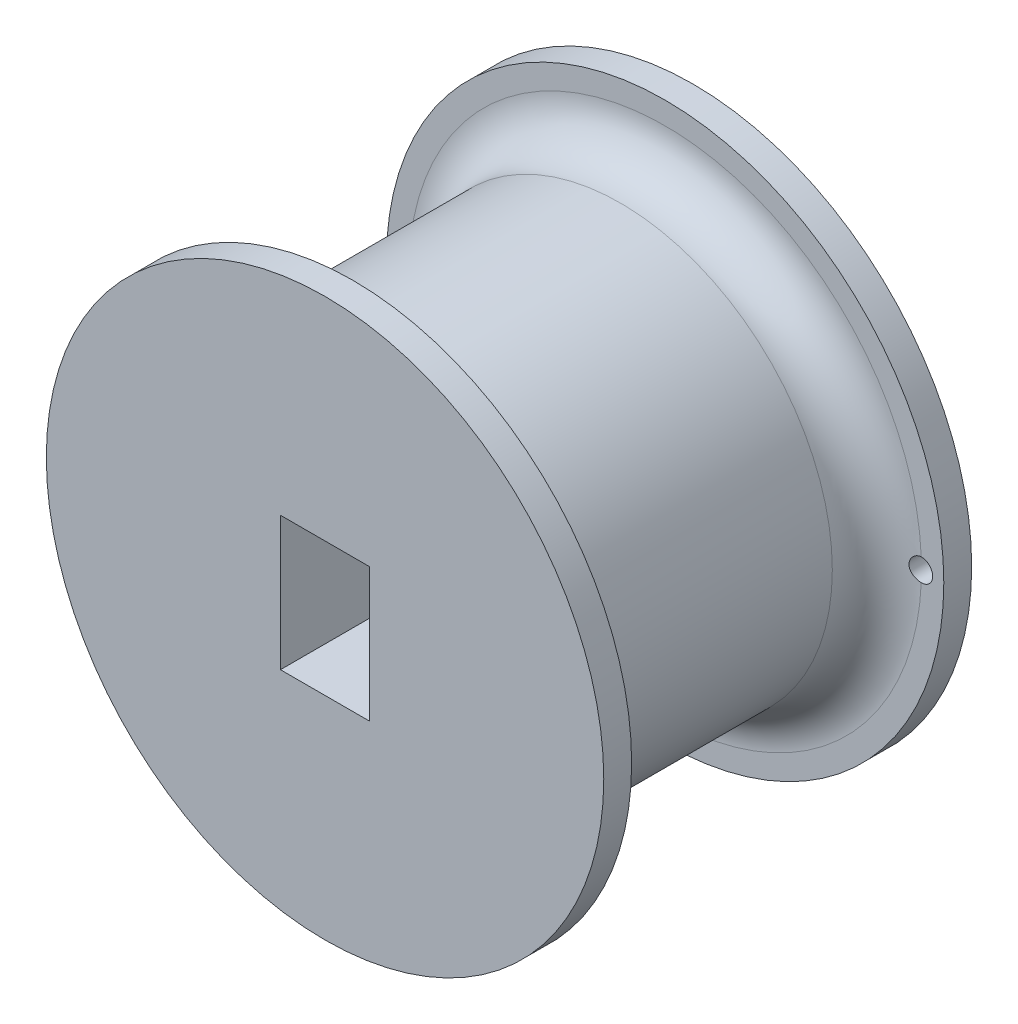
ISO-10303-21;
HEADER;
FILE_DESCRIPTION(('STEP AP214'),'2;1');
FILE_NAME('part.step','',(''),(''),'','','');
FILE_SCHEMA(('AUTOMOTIVE_DESIGN { 1 0 10303 214 1 1 1 1 }'));
ENDSEC;
DATA;
#1=APPLICATION_CONTEXT('core data for automotive mechanical design processes');
#2=APPLICATION_PROTOCOL_DEFINITION('international standard','automotive_design',2000,#1);
#3=PRODUCT_CONTEXT('',#1,'mechanical');
#4=PRODUCT('Part','Part','',(#3));
#5=PRODUCT_RELATED_PRODUCT_CATEGORY('part','',(#4));
#6=PRODUCT_DEFINITION_FORMATION('','',#4);
#7=PRODUCT_DEFINITION_CONTEXT('part definition',#1,'design');
#8=PRODUCT_DEFINITION('design','',#6,#7);
#9=PRODUCT_DEFINITION_SHAPE('','',#8);
#10=(LENGTH_UNIT() NAMED_UNIT(*) SI_UNIT(.MILLI.,.METRE.));
#11=(NAMED_UNIT(*) PLANE_ANGLE_UNIT() SI_UNIT($,.RADIAN.));
#12=(NAMED_UNIT(*) SI_UNIT($,.STERADIAN.) SOLID_ANGLE_UNIT());
#13=UNCERTAINTY_MEASURE_WITH_UNIT(LENGTH_MEASURE(1.E-05),#10,'distance_accuracy_value','');
#14=(GEOMETRIC_REPRESENTATION_CONTEXT(3) GLOBAL_UNCERTAINTY_ASSIGNED_CONTEXT((#13)) GLOBAL_UNIT_ASSIGNED_CONTEXT((#10,
#11,#12)) REPRESENTATION_CONTEXT('',''));
#15=CARTESIAN_POINT('',(0.,0.,0.));
#16=DIRECTION('',(0.,0.,1.));
#17=DIRECTION('',(1.,0.,0.));
#18=AXIS2_PLACEMENT_3D('',#15,#16,#17);
#19=CARTESIAN_POINT('',(0.,0.,2.5));
#20=DIRECTION('',(0.,0.,1.));
#21=DIRECTION('',(1.,0.,0.));
#22=AXIS2_PLACEMENT_3D('',#19,#20,#21);
#23=PLANE('',#22);
#24=CARTESIAN_POINT('',(0.,0.,2.5));
#25=DIRECTION('',(0.,0.,1.));
#26=DIRECTION('',(1.,0.,0.));
#27=AXIS2_PLACEMENT_3D('',#24,#25,#26);
#28=CIRCLE('',#27,25.);
#29=CARTESIAN_POINT('',(25.,0.,2.5));
#30=VERTEX_POINT('',#29);
#31=EDGE_CURVE('E219',#30,#30,#28,.T.);
#32=ORIENTED_EDGE('',*,*,#31,.T.);
#33=EDGE_LOOP('',(#32));
#34=FACE_BOUND('',#33,.T.);
#35=CARTESIAN_POINT('',(0.,0.,2.5));
#36=DIRECTION('',(0.,0.,1.));
#37=DIRECTION('',(1.,0.,0.));
#38=AXIS2_PLACEMENT_3D('',#35,#36,#37);
#39=CIRCLE('',#38,23.);
#40=CARTESIAN_POINT('',(22.9782608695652,-0.999763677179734,2.5));
#41=VERTEX_POINT('',#40);
#42=CARTESIAN_POINT('',(-22.9782608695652,-0.999763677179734,2.5));
#43=VERTEX_POINT('',#42);
#44=EDGE_CURVE('E120',#41,#43,#39,.F.);
#45=ORIENTED_EDGE('',*,*,#44,.T.);
#46=CARTESIAN_POINT('',(-23.,0.,2.5));
#47=DIRECTION('',(0.,0.,1.));
#48=DIRECTION('',(1.,0.,0.));
#49=AXIS2_PLACEMENT_3D('',#46,#47,#48);
#50=CIRCLE('',#49,1.);
#51=CARTESIAN_POINT('',(-22.9782608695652,0.999763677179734,2.5));
#52=VERTEX_POINT('',#51);
#53=EDGE_CURVE('E66',#43,#52,#50,.F.);
#54=ORIENTED_EDGE('',*,*,#53,.T.);
#55=CARTESIAN_POINT('',(22.9782608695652,0.999763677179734,2.5));
#56=VERTEX_POINT('',#55);
#57=EDGE_CURVE('E75',#52,#56,#39,.F.);
#58=ORIENTED_EDGE('',*,*,#57,.T.);
#59=CARTESIAN_POINT('',(23.,0.,2.5));
#60=DIRECTION('',(0.,0.,1.));
#61=DIRECTION('',(1.,0.,0.));
#62=AXIS2_PLACEMENT_3D('',#59,#60,#61);
#63=CIRCLE('',#62,1.);
#64=EDGE_CURVE('E322',#41,#56,#63,.T.);
#65=ORIENTED_EDGE('',*,*,#64,.F.);
#66=EDGE_LOOP('',(#45,#54,#58,#65));
#67=FACE_BOUND('',#66,.T.);
#68=ADVANCED_FACE('F43',(#34,#67),#23,.T.);
#69=CARTESIAN_POINT('',(0.,0.,0.));
#70=DIRECTION('',(0.,0.,1.));
#71=DIRECTION('',(1.,0.,0.));
#72=AXIS2_PLACEMENT_3D('',#69,#70,#71);
#73=PLANE('',#72);
#74=CARTESIAN_POINT('',(23.,0.,0.));
#75=DIRECTION('',(0.,0.,-1.));
#76=DIRECTION('',(-1.,0.,0.));
#77=AXIS2_PLACEMENT_3D('',#74,#75,#76);
#78=CIRCLE('',#77,1.);
#79=CARTESIAN_POINT('',(22.,0.,0.));
#80=VERTEX_POINT('',#79);
#81=EDGE_CURVE('E122',#80,#80,#78,.T.);
#82=ORIENTED_EDGE('',*,*,#81,.F.);
#83=EDGE_LOOP('',(#82));
#84=FACE_BOUND('',#83,.T.);
#85=CARTESIAN_POINT('',(0.,-15.,0.));
#86=DIRECTION('',(0.,0.,-1.));
#87=DIRECTION('',(-1.,0.,0.));
#88=AXIS2_PLACEMENT_3D('',#85,#86,#87);
#89=CIRCLE('',#88,1.5);
#90=CARTESIAN_POINT('',(-1.5,-15.,0.));
#91=VERTEX_POINT('',#90);
#92=EDGE_CURVE('E318',#91,#91,#89,.T.);
#93=ORIENTED_EDGE('',*,*,#92,.F.);
#94=EDGE_LOOP('',(#93));
#95=FACE_BOUND('',#94,.T.);
#96=CARTESIAN_POINT('',(0.,15.,0.));
#97=DIRECTION('',(0.,0.,-1.));
#98=DIRECTION('',(-1.,0.,0.));
#99=AXIS2_PLACEMENT_3D('',#96,#97,#98);
#100=CIRCLE('',#99,1.5);
#101=CARTESIAN_POINT('',(-1.5,15.,0.));
#102=VERTEX_POINT('',#101);
#103=EDGE_CURVE('E259',#102,#102,#100,.T.);
#104=ORIENTED_EDGE('',*,*,#103,.F.);
#105=EDGE_LOOP('',(#104));
#106=FACE_BOUND('',#105,.T.);
#107=CARTESIAN_POINT('',(0.,0.,0.));
#108=DIRECTION('',(0.,0.,1.));
#109=DIRECTION('',(1.,0.,0.));
#110=AXIS2_PLACEMENT_3D('',#107,#108,#109);
#111=CIRCLE('',#110,25.);
#112=CARTESIAN_POINT('',(25.,0.,0.));
#113=VERTEX_POINT('',#112);
#114=EDGE_CURVE('E222',#113,#113,#111,.T.);
#115=ORIENTED_EDGE('',*,*,#114,.F.);
#116=EDGE_LOOP('',(#115));
#117=FACE_BOUND('',#116,.T.);
#118=DIRECTION('',(0.,1.,0.));
#119=VECTOR('',#118,1.);
#120=CARTESIAN_POINT('',(4.,6.,0.));
#121=LINE('',#120,#119);
#122=CARTESIAN_POINT('',(4.,-6.,0.));
#123=VERTEX_POINT('',#122);
#124=CARTESIAN_POINT('',(4.,6.,0.));
#125=VERTEX_POINT('',#124);
#126=EDGE_CURVE('E265',#123,#125,#121,.T.);
#127=ORIENTED_EDGE('',*,*,#126,.T.);
#128=DIRECTION('',(-1.,0.,0.));
#129=VECTOR('',#128,1.);
#130=CARTESIAN_POINT('',(-4.,6.,0.));
#131=LINE('',#130,#129);
#132=CARTESIAN_POINT('',(-4.,6.,0.));
#133=VERTEX_POINT('',#132);
#134=EDGE_CURVE('E269',#125,#133,#131,.T.);
#135=ORIENTED_EDGE('',*,*,#134,.T.);
#136=DIRECTION('',(0.,-1.,0.));
#137=VECTOR('',#136,1.);
#138=CARTESIAN_POINT('',(-4.,6.,0.));
#139=LINE('',#138,#137);
#140=CARTESIAN_POINT('',(-4.,-6.,0.));
#141=VERTEX_POINT('',#140);
#142=EDGE_CURVE('E273',#133,#141,#139,.T.);
#143=ORIENTED_EDGE('',*,*,#142,.T.);
#144=DIRECTION('',(1.,0.,0.));
#145=VECTOR('',#144,1.);
#146=CARTESIAN_POINT('',(-4.,-6.,0.));
#147=LINE('',#146,#145);
#148=EDGE_CURVE('E277',#141,#123,#147,.T.);
#149=ORIENTED_EDGE('',*,*,#148,.T.);
#150=EDGE_LOOP('',(#127,#135,#143,#149));
#151=FACE_BOUND('',#150,.T.);
#152=CARTESIAN_POINT('',(-23.,0.,0.));
#153=DIRECTION('',(0.,0.,1.));
#154=DIRECTION('',(1.,0.,0.));
#155=AXIS2_PLACEMENT_3D('',#152,#153,#154);
#156=CIRCLE('',#155,1.);
#157=CARTESIAN_POINT('',(-22.,0.,0.));
#158=VERTEX_POINT('',#157);
#159=EDGE_CURVE('E123',#158,#158,#156,.T.);
#160=ORIENTED_EDGE('',*,*,#159,.T.);
#161=EDGE_LOOP('',(#160));
#162=FACE_BOUND('',#161,.T.);
#163=ADVANCED_FACE('F206',(#84,#95,#106,#117,#151,#162),#73,.F.);
#164=CARTESIAN_POINT('',(0.,0.,6.5));
#165=DIRECTION('',(0.,0.,1.));
#166=DIRECTION('',(1.,0.,0.));
#167=AXIS2_PLACEMENT_3D('',#164,#165,#166);
#168=TOROIDAL_SURFACE('',#167,23.,4.);
#169=CARTESIAN_POINT('',(0.,0.,6.5));
#170=DIRECTION('',(0.,0.,1.));
#171=DIRECTION('',(1.,0.,0.));
#172=AXIS2_PLACEMENT_3D('',#169,#170,#171);
#173=CIRCLE('',#172,19.);
#174=CARTESIAN_POINT('',(19.,0.,6.5));
#175=VERTEX_POINT('',#174);
#176=EDGE_CURVE('E128',#175,#175,#173,.T.);
#177=ORIENTED_EDGE('',*,*,#176,.F.);
#178=EDGE_LOOP('',(#177));
#179=FACE_BOUND('',#178,.T.);
#180=CARTESIAN_POINT('',(-23.0002,-0.999999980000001,2.50006010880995));
#181=CARTESIAN_POINT('',(-22.9725756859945,-1.00000580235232,2.49990725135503));
#182=CARTESIAN_POINT('',(-22.9449630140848,-0.998865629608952,2.50004329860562));
#183=CARTESIAN_POINT('',(-22.8899388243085,-0.99430837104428,2.50088366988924));
#184=CARTESIAN_POINT('',(-22.862527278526,-0.990891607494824,2.50158791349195));
#185=CARTESIAN_POINT('',(-22.7810021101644,-0.977274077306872,2.50453318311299));
#186=CARTESIAN_POINT('',(-22.7274409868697,-0.963705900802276,2.50760600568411));
#187=CARTESIAN_POINT('',(-22.6234355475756,-0.928023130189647,2.51566010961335));
#188=CARTESIAN_POINT('',(-22.5729913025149,-0.905908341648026,2.52064143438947));
#189=CARTESIAN_POINT('',(-22.4765118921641,-0.853794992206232,2.53198889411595));
#190=CARTESIAN_POINT('',(-22.4304777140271,-0.823794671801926,2.53835533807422));
#191=CARTESIAN_POINT('',(-22.3432194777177,-0.756136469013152,2.55191950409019));
#192=CARTESIAN_POINT('',(-22.3020964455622,-0.718350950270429,2.55913008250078));
#193=CARTESIAN_POINT('',(-22.2266840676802,-0.636460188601,2.57348664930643));
#194=CARTESIAN_POINT('',(-22.1923962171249,-0.592353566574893,2.58063262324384));
#195=CARTESIAN_POINT('',(-22.1310412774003,-0.498122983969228,2.59415607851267));
#196=CARTESIAN_POINT('',(-22.1041125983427,-0.447906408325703,2.60051773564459));
#197=CARTESIAN_POINT('',(-22.0591198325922,-0.343475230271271,2.61152489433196));
#198=CARTESIAN_POINT('',(-22.0410537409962,-0.289261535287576,2.61617078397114));
#199=CARTESIAN_POINT('',(-22.0146614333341,-0.179521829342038,2.62306582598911));
#200=CARTESIAN_POINT('',(-22.0061464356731,-0.124044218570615,2.62536135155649));
#201=CARTESIAN_POINT('',(-21.9985134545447,-0.0124030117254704,2.62741578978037));
#202=CARTESIAN_POINT('',(-21.9993939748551,0.043760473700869,2.62717510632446));
#203=CARTESIAN_POINT('',(-22.0103636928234,0.153565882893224,2.62423171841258));
#204=CARTESIAN_POINT('',(-22.0202026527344,0.207234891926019,2.62159592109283));
#205=CARTESIAN_POINT('',(-22.0484102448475,0.312133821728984,2.61428428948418));
#206=CARTESIAN_POINT('',(-22.0667795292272,0.363363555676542,2.60960829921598));
#207=CARTESIAN_POINT('',(-22.1117375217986,0.462590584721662,2.59871248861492));
#208=CARTESIAN_POINT('',(-22.1384154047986,0.51054557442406,2.59247607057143));
#209=CARTESIAN_POINT('',(-22.1991758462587,0.601388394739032,2.57920652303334));
#210=CARTESIAN_POINT('',(-22.2332596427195,0.644275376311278,2.57217326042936));
#211=CARTESIAN_POINT('',(-22.3091149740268,0.725151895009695,2.5578685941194));
#212=CARTESIAN_POINT('',(-22.3510911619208,0.762949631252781,2.55059653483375));
#213=CARTESIAN_POINT('',(-22.4408994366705,0.831011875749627,2.53685589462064));
#214=CARTESIAN_POINT('',(-22.4887328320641,0.861274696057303,2.53038749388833));
#215=CARTESIAN_POINT('',(-22.5890798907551,0.913428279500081,2.51896730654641));
#216=CARTESIAN_POINT('',(-22.6416045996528,0.935298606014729,2.51401922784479));
#217=CARTESIAN_POINT('',(-22.7497103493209,0.969826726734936,2.50622170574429));
#218=CARTESIAN_POINT('',(-22.8052869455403,0.982497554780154,2.50336929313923));
#219=CARTESIAN_POINT('',(-22.8844880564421,0.993578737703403,2.5010359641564));
#220=CARTESIAN_POINT('',(-22.907581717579,0.995991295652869,2.50055878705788));
#221=CARTESIAN_POINT('',(-22.9538470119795,0.999202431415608,2.50000757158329));
#222=CARTESIAN_POINT('',(-22.9770184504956,1.00000369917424,2.49993286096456));
#223=CARTESIAN_POINT('',(-23.0002,0.999999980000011,2.50006010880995));
#224=B_SPLINE_CURVE_WITH_KNOTS('',3,(#180,#181,#182,#183,#184,#185,#186,#187,#188,#189,#190,
#191,#192,#193,#194,#195,#196,#197,#198,#199,#200,#201,#202,#203,#204,#205,#206,#207,#208,#209,
#210,#211,#212,#213,#214,#215,#216,#217,#218,#219,#220,#221,#222,#223),.UNSPECIFIED.,.F.,.F.,(4,
2,2,2,2,2,2,2,2,2,2,2,2,2,2,2,2,2,2,2,2,4),(0.,0.0828223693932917,0.165633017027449,
0.33078952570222,0.495949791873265,0.661146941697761,0.8293055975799,0.997500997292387,
1.16867067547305,1.3398016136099,1.50748695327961,1.67514558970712,1.83826002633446,
2.00138693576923,2.16632878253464,2.33129822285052,2.50135474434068,2.67144932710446,
2.84195551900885,3.01221966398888,3.08184415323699,3.15135231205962),.UNSPECIFIED.);
#225=EDGE_CURVE('E11',#43,#52,#224,.T.);
#226=ORIENTED_EDGE('',*,*,#225,.F.);
#227=ORIENTED_EDGE('',*,*,#44,.F.);
#228=CARTESIAN_POINT('',(23.0002,-0.999999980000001,2.50006010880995));
#229=CARTESIAN_POINT('',(22.9725756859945,-1.00000580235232,2.49990725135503));
#230=CARTESIAN_POINT('',(22.9449630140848,-0.998865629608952,2.50004329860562));
#231=CARTESIAN_POINT('',(22.8899388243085,-0.99430837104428,2.50088366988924));
#232=CARTESIAN_POINT('',(22.862527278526,-0.990891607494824,2.50158791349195));
#233=CARTESIAN_POINT('',(22.7810021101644,-0.977274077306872,2.50453318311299));
#234=CARTESIAN_POINT('',(22.7274409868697,-0.963705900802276,2.50760600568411));
#235=CARTESIAN_POINT('',(22.6234355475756,-0.928023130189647,2.51566010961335));
#236=CARTESIAN_POINT('',(22.5729913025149,-0.905908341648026,2.52064143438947));
#237=CARTESIAN_POINT('',(22.4765118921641,-0.853794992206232,2.53198889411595));
#238=CARTESIAN_POINT('',(22.4304777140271,-0.823794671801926,2.53835533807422));
#239=CARTESIAN_POINT('',(22.3432194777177,-0.756136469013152,2.55191950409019));
#240=CARTESIAN_POINT('',(22.3020964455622,-0.718350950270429,2.55913008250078));
#241=CARTESIAN_POINT('',(22.2266840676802,-0.636460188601,2.57348664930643));
#242=CARTESIAN_POINT('',(22.1923962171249,-0.592353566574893,2.58063262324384));
#243=CARTESIAN_POINT('',(22.1310412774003,-0.498122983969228,2.59415607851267));
#244=CARTESIAN_POINT('',(22.1041125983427,-0.447906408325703,2.60051773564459));
#245=CARTESIAN_POINT('',(22.0591198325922,-0.343475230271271,2.61152489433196));
#246=CARTESIAN_POINT('',(22.0410537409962,-0.289261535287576,2.61617078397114));
#247=CARTESIAN_POINT('',(22.0146614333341,-0.179521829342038,2.62306582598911));
#248=CARTESIAN_POINT('',(22.0061464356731,-0.124044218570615,2.62536135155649));
#249=CARTESIAN_POINT('',(21.9985134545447,-0.0124030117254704,2.62741578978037));
#250=CARTESIAN_POINT('',(21.9993939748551,0.043760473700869,2.62717510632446));
#251=CARTESIAN_POINT('',(22.0103636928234,0.153565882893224,2.62423171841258));
#252=CARTESIAN_POINT('',(22.0202026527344,0.207234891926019,2.62159592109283));
#253=CARTESIAN_POINT('',(22.0484102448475,0.312133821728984,2.61428428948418));
#254=CARTESIAN_POINT('',(22.0667795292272,0.363363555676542,2.60960829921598));
#255=CARTESIAN_POINT('',(22.1117375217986,0.462590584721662,2.59871248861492));
#256=CARTESIAN_POINT('',(22.1384154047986,0.51054557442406,2.59247607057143));
#257=CARTESIAN_POINT('',(22.1991758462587,0.601388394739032,2.57920652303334));
#258=CARTESIAN_POINT('',(22.2332596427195,0.644275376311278,2.57217326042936));
#259=CARTESIAN_POINT('',(22.3091149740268,0.725151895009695,2.5578685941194));
#260=CARTESIAN_POINT('',(22.3510911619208,0.762949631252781,2.55059653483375));
#261=CARTESIAN_POINT('',(22.4408994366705,0.831011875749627,2.53685589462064));
#262=CARTESIAN_POINT('',(22.4887328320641,0.861274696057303,2.53038749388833));
#263=CARTESIAN_POINT('',(22.5890798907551,0.913428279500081,2.51896730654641));
#264=CARTESIAN_POINT('',(22.6416045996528,0.935298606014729,2.51401922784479));
#265=CARTESIAN_POINT('',(22.7497103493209,0.969826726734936,2.50622170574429));
#266=CARTESIAN_POINT('',(22.8052869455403,0.982497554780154,2.50336929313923));
#267=CARTESIAN_POINT('',(22.8844880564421,0.993578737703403,2.5010359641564));
#268=CARTESIAN_POINT('',(22.907581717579,0.995991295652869,2.50055878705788));
#269=CARTESIAN_POINT('',(22.9538470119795,0.999202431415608,2.50000757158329));
#270=CARTESIAN_POINT('',(22.9770184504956,1.00000369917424,2.49993286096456));
#271=CARTESIAN_POINT('',(23.0002,0.999999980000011,2.50006010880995));
#272=B_SPLINE_CURVE_WITH_KNOTS('',3,(#228,#229,#230,#231,#232,#233,#234,#235,#236,#237,#238,
#239,#240,#241,#242,#243,#244,#245,#246,#247,#248,#249,#250,#251,#252,#253,#254,#255,#256,#257,
#258,#259,#260,#261,#262,#263,#264,#265,#266,#267,#268,#269,#270,#271),.UNSPECIFIED.,.F.,.F.,(4,
2,2,2,2,2,2,2,2,2,2,2,2,2,2,2,2,2,2,2,2,4),(0.,0.0828223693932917,0.165633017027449,
0.33078952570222,0.495949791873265,0.661146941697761,0.8293055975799,0.997500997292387,
1.16867067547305,1.3398016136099,1.50748695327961,1.67514558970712,1.83826002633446,
2.00138693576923,2.16632878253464,2.33129822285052,2.50135474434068,2.67144932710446,
2.84195551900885,3.01221966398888,3.08184415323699,3.15135231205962),.UNSPECIFIED.);
#273=EDGE_CURVE('E57',#41,#56,#272,.T.);
#274=ORIENTED_EDGE('',*,*,#273,.T.);
#275=ORIENTED_EDGE('',*,*,#57,.F.);
#276=EDGE_LOOP('',(#226,#227,#274,#275));
#277=FACE_BOUND('',#276,.T.);
#278=ADVANCED_FACE('F126',(#179,#277),#168,.F.);
#279=CARTESIAN_POINT('',(0.,0.,2.5));
#280=DIRECTION('',(0.,0.,-1.));
#281=DIRECTION('',(-1.,0.,0.));
#282=AXIS2_PLACEMENT_3D('',#279,#280,#281);
#283=CYLINDRICAL_SURFACE('',#282,25.);
#284=ORIENTED_EDGE('',*,*,#31,.F.);
#285=EDGE_LOOP('',(#284));
#286=FACE_BOUND('',#285,.T.);
#287=ORIENTED_EDGE('',*,*,#114,.T.);
#288=EDGE_LOOP('',(#287));
#289=FACE_BOUND('',#288,.T.);
#290=ADVANCED_FACE('F202',(#286,#289),#283,.T.);
#291=CARTESIAN_POINT('',(4.,6.,2.5));
#292=DIRECTION('',(-1.,0.,0.));
#293=DIRECTION('',(0.,-1.,0.));
#294=AXIS2_PLACEMENT_3D('',#291,#292,#293);
#295=PLANE('',#294);
#296=ORIENTED_EDGE('',*,*,#126,.F.);
#297=DIRECTION('',(0.,0.,-1.));
#298=VECTOR('',#297,1.);
#299=CARTESIAN_POINT('',(4.,-6.,2.5));
#300=LINE('',#299,#298);
#301=CARTESIAN_POINT('',(4.,-6.,33.));
#302=VERTEX_POINT('',#301);
#303=EDGE_CURVE('E281',#302,#123,#300,.T.);
#304=ORIENTED_EDGE('',*,*,#303,.F.);
#305=DIRECTION('',(0.,-1.,0.));
#306=VECTOR('',#305,1.);
#307=CARTESIAN_POINT('',(4.,0.,33.));
#308=LINE('',#307,#306);
#309=CARTESIAN_POINT('',(4.,6.,33.));
#310=VERTEX_POINT('',#309);
#311=EDGE_CURVE('E305',#310,#302,#308,.T.);
#312=ORIENTED_EDGE('',*,*,#311,.F.);
#313=DIRECTION('',(0.,0.,-1.));
#314=VECTOR('',#313,1.);
#315=CARTESIAN_POINT('',(4.,6.,2.5));
#316=LINE('',#315,#314);
#317=EDGE_CURVE('E225',#310,#125,#316,.T.);
#318=ORIENTED_EDGE('',*,*,#317,.T.);
#319=EDGE_LOOP('',(#296,#304,#312,#318));
#320=FACE_BOUND('',#319,.T.);
#321=ADVANCED_FACE('F198',(#320),#295,.T.);
#322=CARTESIAN_POINT('',(-4.,6.,2.5));
#323=DIRECTION('',(0.,-1.,0.));
#324=DIRECTION('',(0.,0.,-1.));
#325=AXIS2_PLACEMENT_3D('',#322,#323,#324);
#326=PLANE('',#325);
#327=ORIENTED_EDGE('',*,*,#134,.F.);
#328=ORIENTED_EDGE('',*,*,#317,.F.);
#329=DIRECTION('',(1.,0.,0.));
#330=VECTOR('',#329,1.);
#331=CARTESIAN_POINT('',(0.,6.,33.));
#332=LINE('',#331,#330);
#333=CARTESIAN_POINT('',(-4.,6.,33.));
#334=VERTEX_POINT('',#333);
#335=EDGE_CURVE('E293',#334,#310,#332,.T.);
#336=ORIENTED_EDGE('',*,*,#335,.F.);
#337=DIRECTION('',(0.,0.,-1.));
#338=VECTOR('',#337,1.);
#339=CARTESIAN_POINT('',(-4.,6.,2.5));
#340=LINE('',#339,#338);
#341=EDGE_CURVE('E232',#334,#133,#340,.T.);
#342=ORIENTED_EDGE('',*,*,#341,.T.);
#343=EDGE_LOOP('',(#327,#328,#336,#342));
#344=FACE_BOUND('',#343,.T.);
#345=ADVANCED_FACE('F194',(#344),#326,.T.);
#346=CARTESIAN_POINT('',(-4.,6.,2.5));
#347=DIRECTION('',(1.,0.,0.));
#348=DIRECTION('',(0.,1.,0.));
#349=AXIS2_PLACEMENT_3D('',#346,#347,#348);
#350=PLANE('',#349);
#351=ORIENTED_EDGE('',*,*,#142,.F.);
#352=ORIENTED_EDGE('',*,*,#341,.F.);
#353=DIRECTION('',(0.,1.,0.));
#354=VECTOR('',#353,1.);
#355=CARTESIAN_POINT('',(-4.,0.,33.));
#356=LINE('',#355,#354);
#357=CARTESIAN_POINT('',(-4.,-6.,33.));
#358=VERTEX_POINT('',#357);
#359=EDGE_CURVE('E256',#358,#334,#356,.T.);
#360=ORIENTED_EDGE('',*,*,#359,.F.);
#361=DIRECTION('',(0.,0.,-1.));
#362=VECTOR('',#361,1.);
#363=CARTESIAN_POINT('',(-4.,-6.,2.5));
#364=LINE('',#363,#362);
#365=EDGE_CURVE('E285',#358,#141,#364,.T.);
#366=ORIENTED_EDGE('',*,*,#365,.T.);
#367=EDGE_LOOP('',(#351,#352,#360,#366));
#368=FACE_BOUND('',#367,.T.);
#369=ADVANCED_FACE('F190',(#368),#350,.T.);
#370=CARTESIAN_POINT('',(-4.,-6.,2.5));
#371=DIRECTION('',(0.,1.,0.));
#372=DIRECTION('',(0.,0.,1.));
#373=AXIS2_PLACEMENT_3D('',#370,#371,#372);
#374=PLANE('',#373);
#375=ORIENTED_EDGE('',*,*,#148,.F.);
#376=ORIENTED_EDGE('',*,*,#365,.F.);
#377=DIRECTION('',(-1.,0.,0.));
#378=VECTOR('',#377,1.);
#379=CARTESIAN_POINT('',(0.,-6.,33.));
#380=LINE('',#379,#378);
#381=EDGE_CURVE('E263',#302,#358,#380,.T.);
#382=ORIENTED_EDGE('',*,*,#381,.F.);
#383=ORIENTED_EDGE('',*,*,#303,.T.);
#384=EDGE_LOOP('',(#375,#376,#382,#383));
#385=FACE_BOUND('',#384,.T.);
#386=ADVANCED_FACE('F186',(#385),#374,.T.);
#387=CARTESIAN_POINT('',(0.,0.,30.5));
#388=DIRECTION('',(0.,0.,-1.));
#389=DIRECTION('',(-1.,0.,0.));
#390=AXIS2_PLACEMENT_3D('',#387,#388,#389);
#391=CYLINDRICAL_SURFACE('',#390,19.);
#392=ORIENTED_EDGE('',*,*,#176,.T.);
#393=EDGE_LOOP('',(#392));
#394=FACE_BOUND('',#393,.T.);
#395=CARTESIAN_POINT('',(0.,0.,26.5));
#396=DIRECTION('',(0.,0.,1.));
#397=DIRECTION('',(1.,0.,0.));
#398=AXIS2_PLACEMENT_3D('',#395,#396,#397);
#399=CIRCLE('',#398,19.);
#400=CARTESIAN_POINT('',(19.,0.,26.5));
#401=VERTEX_POINT('',#400);
#402=EDGE_CURVE('E135',#401,#401,#399,.F.);
#403=ORIENTED_EDGE('',*,*,#402,.T.);
#404=EDGE_LOOP('',(#403));
#405=FACE_BOUND('',#404,.T.);
#406=ADVANCED_FACE('F179',(#394,#405),#391,.T.);
#407=CARTESIAN_POINT('',(0.,0.,30.5));
#408=DIRECTION('',(0.,0.,1.));
#409=DIRECTION('',(1.,0.,0.));
#410=AXIS2_PLACEMENT_3D('',#407,#408,#409);
#411=PLANE('',#410);
#412=CARTESIAN_POINT('',(0.,0.,30.5));
#413=DIRECTION('',(0.,0.,1.));
#414=DIRECTION('',(1.,0.,0.));
#415=AXIS2_PLACEMENT_3D('',#412,#413,#414);
#416=CIRCLE('',#415,23.);
#417=CARTESIAN_POINT('',(23.,0.,30.5));
#418=VERTEX_POINT('',#417);
#419=EDGE_CURVE('E133',#418,#418,#416,.T.);
#420=ORIENTED_EDGE('',*,*,#419,.T.);
#421=EDGE_LOOP('',(#420));
#422=FACE_BOUND('',#421,.T.);
#423=CARTESIAN_POINT('',(0.,0.,30.5));
#424=DIRECTION('',(0.,0.,1.));
#425=DIRECTION('',(1.,0.,0.));
#426=AXIS2_PLACEMENT_3D('',#423,#424,#425);
#427=CIRCLE('',#426,25.);
#428=CARTESIAN_POINT('',(25.,0.,30.5));
#429=VERTEX_POINT('',#428);
#430=EDGE_CURVE('E246',#429,#429,#427,.T.);
#431=ORIENTED_EDGE('',*,*,#430,.F.);
#432=EDGE_LOOP('',(#431));
#433=FACE_BOUND('',#432,.T.);
#434=ADVANCED_FACE('F176',(#422,#433),#411,.F.);
#435=CARTESIAN_POINT('',(0.,0.,33.));
#436=DIRECTION('',(0.,0.,-1.));
#437=DIRECTION('',(-1.,0.,0.));
#438=AXIS2_PLACEMENT_3D('',#435,#436,#437);
#439=CYLINDRICAL_SURFACE('',#438,25.);
#440=CARTESIAN_POINT('',(0.,0.,33.));
#441=DIRECTION('',(0.,0.,1.));
#442=DIRECTION('',(1.,0.,0.));
#443=AXIS2_PLACEMENT_3D('',#440,#441,#442);
#444=CIRCLE('',#443,25.);
#445=CARTESIAN_POINT('',(25.,0.,33.));
#446=VERTEX_POINT('',#445);
#447=EDGE_CURVE('E249',#446,#446,#444,.T.);
#448=ORIENTED_EDGE('',*,*,#447,.F.);
#449=EDGE_LOOP('',(#448));
#450=FACE_BOUND('',#449,.T.);
#451=ORIENTED_EDGE('',*,*,#430,.T.);
#452=EDGE_LOOP('',(#451));
#453=FACE_BOUND('',#452,.T.);
#454=ADVANCED_FACE('F174',(#450,#453),#439,.T.);
#455=CARTESIAN_POINT('',(0.,0.,33.));
#456=DIRECTION('',(0.,0.,1.));
#457=DIRECTION('',(1.,0.,0.));
#458=AXIS2_PLACEMENT_3D('',#455,#456,#457);
#459=PLANE('',#458);
#460=ORIENTED_EDGE('',*,*,#447,.T.);
#461=EDGE_LOOP('',(#460));
#462=FACE_BOUND('',#461,.T.);
#463=ORIENTED_EDGE('',*,*,#359,.T.);
#464=ORIENTED_EDGE('',*,*,#335,.T.);
#465=ORIENTED_EDGE('',*,*,#311,.T.);
#466=ORIENTED_EDGE('',*,*,#381,.T.);
#467=EDGE_LOOP('',(#463,#464,#465,#466));
#468=FACE_BOUND('',#467,.T.);
#469=ADVANCED_FACE('F171',(#462,#468),#459,.T.);
#470=CARTESIAN_POINT('',(0.,0.,26.5));
#471=DIRECTION('',(0.,0.,1.));
#472=DIRECTION('',(1.,0.,0.));
#473=AXIS2_PLACEMENT_3D('',#470,#471,#472);
#474=TOROIDAL_SURFACE('',#473,23.,4.);
#475=ORIENTED_EDGE('',*,*,#402,.F.);
#476=EDGE_LOOP('',(#475));
#477=FACE_BOUND('',#476,.T.);
#478=ORIENTED_EDGE('',*,*,#419,.F.);
#479=EDGE_LOOP('',(#478));
#480=FACE_BOUND('',#479,.T.);
#481=ADVANCED_FACE('F45',(#477,#480),#474,.F.);
#482=CARTESIAN_POINT('',(0.,15.,10.));
#483=DIRECTION('',(0.,0.,-1.));
#484=DIRECTION('',(-1.,0.,0.));
#485=AXIS2_PLACEMENT_3D('',#482,#483,#484);
#486=CYLINDRICAL_SURFACE('',#485,1.5);
#487=CARTESIAN_POINT('',(0.,15.,10.));
#488=DIRECTION('',(0.,0.,-1.));
#489=DIRECTION('',(-1.,0.,0.));
#490=AXIS2_PLACEMENT_3D('',#487,#488,#489);
#491=CIRCLE('',#490,1.5);
#492=CARTESIAN_POINT('',(-1.5,15.,10.));
#493=VERTEX_POINT('',#492);
#494=EDGE_CURVE('E250',#493,#493,#491,.T.);
#495=ORIENTED_EDGE('',*,*,#494,.F.);
#496=EDGE_LOOP('',(#495));
#497=FACE_BOUND('',#496,.T.);
#498=ORIENTED_EDGE('',*,*,#103,.T.);
#499=EDGE_LOOP('',(#498));
#500=FACE_BOUND('',#499,.T.);
#501=ADVANCED_FACE('F166',(#497,#500),#486,.F.);
#502=CARTESIAN_POINT('',(0.,15.,10.));
#503=DIRECTION('',(0.,0.,-1.));
#504=DIRECTION('',(-1.,0.,0.));
#505=AXIS2_PLACEMENT_3D('',#502,#503,#504);
#506=PLANE('',#505);
#507=ORIENTED_EDGE('',*,*,#494,.T.);
#508=EDGE_LOOP('',(#507));
#509=FACE_BOUND('',#508,.T.);
#510=ADVANCED_FACE('F162',(#509),#506,.T.);
#511=CARTESIAN_POINT('',(0.,-15.,10.));
#512=DIRECTION('',(0.,0.,-1.));
#513=DIRECTION('',(-1.,0.,0.));
#514=AXIS2_PLACEMENT_3D('',#511,#512,#513);
#515=CYLINDRICAL_SURFACE('',#514,1.5);
#516=CARTESIAN_POINT('',(0.,-15.,10.));
#517=DIRECTION('',(0.,0.,-1.));
#518=DIRECTION('',(-1.,0.,0.));
#519=AXIS2_PLACEMENT_3D('',#516,#517,#518);
#520=CIRCLE('',#519,1.5);
#521=CARTESIAN_POINT('',(-1.5,-15.,10.));
#522=VERTEX_POINT('',#521);
#523=EDGE_CURVE('E316',#522,#522,#520,.T.);
#524=ORIENTED_EDGE('',*,*,#523,.F.);
#525=EDGE_LOOP('',(#524));
#526=FACE_BOUND('',#525,.T.);
#527=ORIENTED_EDGE('',*,*,#92,.T.);
#528=EDGE_LOOP('',(#527));
#529=FACE_BOUND('',#528,.T.);
#530=ADVANCED_FACE('F158',(#526,#529),#515,.F.);
#531=CARTESIAN_POINT('',(0.,-15.,10.));
#532=DIRECTION('',(0.,0.,-1.));
#533=DIRECTION('',(-1.,0.,0.));
#534=AXIS2_PLACEMENT_3D('',#531,#532,#533);
#535=PLANE('',#534);
#536=ORIENTED_EDGE('',*,*,#523,.T.);
#537=EDGE_LOOP('',(#536));
#538=FACE_BOUND('',#537,.T.);
#539=ADVANCED_FACE('F153',(#538),#535,.T.);
#540=CARTESIAN_POINT('',(23.,0.,10.));
#541=DIRECTION('',(0.,0.,-1.));
#542=DIRECTION('',(-1.,0.,0.));
#543=AXIS2_PLACEMENT_3D('',#540,#541,#542);
#544=CYLINDRICAL_SURFACE('',#543,1.);
#545=ORIENTED_EDGE('',*,*,#64,.T.);
#546=ORIENTED_EDGE('',*,*,#273,.F.);
#547=EDGE_LOOP('',(#545,#546));
#548=FACE_BOUND('',#547,.T.);
#549=ORIENTED_EDGE('',*,*,#81,.T.);
#550=EDGE_LOOP('',(#549));
#551=FACE_BOUND('',#550,.T.);
#552=ADVANCED_FACE('F149',(#548,#551),#544,.F.);
#553=CARTESIAN_POINT('',(-23.,0.,10.));
#554=DIRECTION('',(0.,0.,-1.));
#555=DIRECTION('',(-1.,0.,0.));
#556=AXIS2_PLACEMENT_3D('',#553,#554,#555);
#557=CYLINDRICAL_SURFACE('',#556,1.);
#558=ORIENTED_EDGE('',*,*,#225,.T.);
#559=ORIENTED_EDGE('',*,*,#53,.F.);
#560=EDGE_LOOP('',(#558,#559));
#561=FACE_BOUND('',#560,.T.);
#562=ORIENTED_EDGE('',*,*,#159,.F.);
#563=EDGE_LOOP('',(#562));
#564=FACE_BOUND('',#563,.T.);
#565=ADVANCED_FACE('F115',(#561,#564),#557,.F.);
#566=CLOSED_SHELL('',(#68,#163,#278,#290,#321,#345,#369,#386,#406,#434,#454,#469,#481,#501,#510,
#530,#539,#552,#565));
#567=MANIFOLD_SOLID_BREP('B2',#566);
#568=ADVANCED_BREP_SHAPE_REPRESENTATION('',(#18,#567),#14);
#569=SHAPE_DEFINITION_REPRESENTATION(#9,#568);
ENDSEC;
END-ISO-10303-21;
